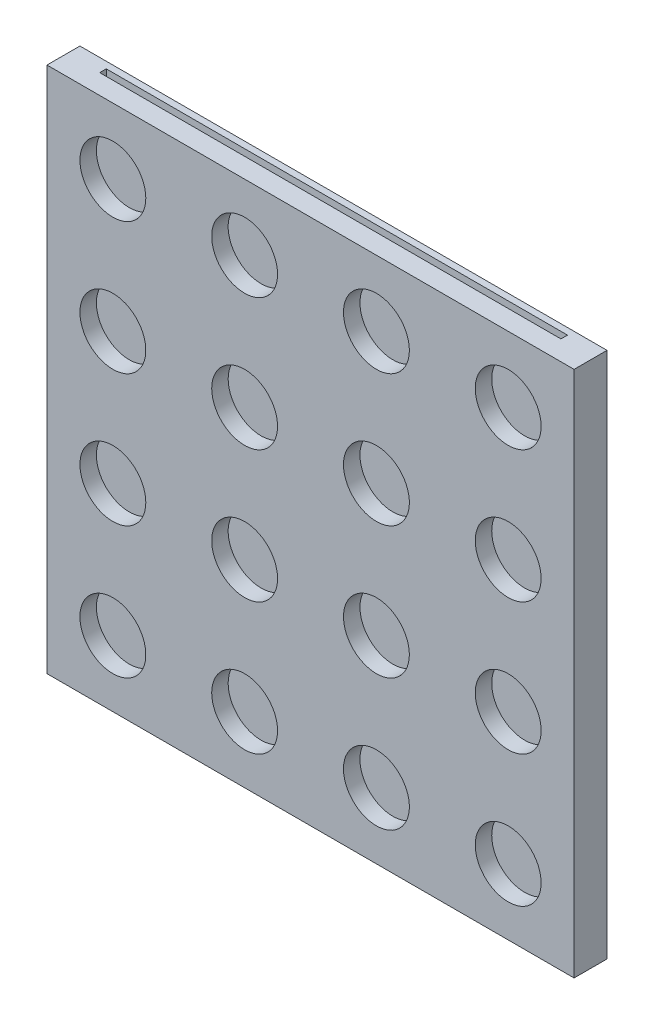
ISO-10303-21;
HEADER;
FILE_DESCRIPTION(('STEP AP214'),'2;1');
FILE_NAME('part.step','',(''),(''),'','','');
FILE_SCHEMA(('AUTOMOTIVE_DESIGN { 1 0 10303 214 1 1 1 1 }'));
ENDSEC;
DATA;
#1=APPLICATION_CONTEXT('core data for automotive mechanical design processes');
#2=APPLICATION_PROTOCOL_DEFINITION('international standard','automotive_design',2000,#1);
#3=PRODUCT_CONTEXT('',#1,'mechanical');
#4=PRODUCT('Part','Part','',(#3));
#5=PRODUCT_RELATED_PRODUCT_CATEGORY('part','',(#4));
#6=PRODUCT_DEFINITION_FORMATION('','',#4);
#7=PRODUCT_DEFINITION_CONTEXT('part definition',#1,'design');
#8=PRODUCT_DEFINITION('design','',#6,#7);
#9=PRODUCT_DEFINITION_SHAPE('','',#8);
#10=(LENGTH_UNIT() NAMED_UNIT(*) SI_UNIT(.MILLI.,.METRE.));
#11=(NAMED_UNIT(*) PLANE_ANGLE_UNIT() SI_UNIT($,.RADIAN.));
#12=(NAMED_UNIT(*) SI_UNIT($,.STERADIAN.) SOLID_ANGLE_UNIT());
#13=UNCERTAINTY_MEASURE_WITH_UNIT(LENGTH_MEASURE(1.E-05),#10,'distance_accuracy_value','');
#14=(GEOMETRIC_REPRESENTATION_CONTEXT(3) GLOBAL_UNCERTAINTY_ASSIGNED_CONTEXT((#13)) GLOBAL_UNIT_ASSIGNED_CONTEXT((#10,
#11,#12)) REPRESENTATION_CONTEXT('',''));
#15=CARTESIAN_POINT('',(0.,0.,0.));
#16=DIRECTION('',(0.,0.,1.));
#17=DIRECTION('',(1.,0.,0.));
#18=AXIS2_PLACEMENT_3D('',#15,#16,#17);
#19=CARTESIAN_POINT('',(0.,0.,6.35));
#20=DIRECTION('',(0.,0.,-1.));
#21=DIRECTION('',(-1.,0.,0.));
#22=AXIS2_PLACEMENT_3D('',#19,#20,#21);
#23=PLANE('',#22);
#24=CARTESIAN_POINT('',(12.7,63.5,6.35));
#25=DIRECTION('',(0.,0.,-1.));
#26=DIRECTION('',(-1.,0.,0.));
#27=AXIS2_PLACEMENT_3D('',#24,#25,#26);
#28=CIRCLE('',#27,6.35);
#29=CARTESIAN_POINT('',(6.35,63.5,6.35));
#30=VERTEX_POINT('',#29);
#31=EDGE_CURVE('E257',#30,#30,#28,.T.);
#32=ORIENTED_EDGE('',*,*,#31,.T.);
#33=EDGE_LOOP('',(#32));
#34=FACE_BOUND('',#33,.T.);
#35=CARTESIAN_POINT('',(63.5,88.9,6.35));
#36=DIRECTION('',(0.,0.,1.));
#37=DIRECTION('',(1.,0.,0.));
#38=AXIS2_PLACEMENT_3D('',#35,#36,#37);
#39=CIRCLE('',#38,6.34999999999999);
#40=CARTESIAN_POINT('',(69.85,88.9,6.35));
#41=VERTEX_POINT('',#40);
#42=EDGE_CURVE('E273',#41,#41,#39,.T.);
#43=ORIENTED_EDGE('',*,*,#42,.F.);
#44=EDGE_LOOP('',(#43));
#45=FACE_BOUND('',#44,.T.);
#46=CARTESIAN_POINT('',(12.7,38.1,6.35));
#47=DIRECTION('',(0.,0.,1.));
#48=DIRECTION('',(1.,0.,0.));
#49=AXIS2_PLACEMENT_3D('',#46,#47,#48);
#50=CIRCLE('',#49,6.35);
#51=CARTESIAN_POINT('',(19.05,38.1,6.35));
#52=VERTEX_POINT('',#51);
#53=EDGE_CURVE('E225',#52,#52,#50,.T.);
#54=ORIENTED_EDGE('',*,*,#53,.F.);
#55=EDGE_LOOP('',(#54));
#56=FACE_BOUND('',#55,.T.);
#57=CARTESIAN_POINT('',(88.9,63.5,6.35));
#58=DIRECTION('',(0.,0.,-1.));
#59=DIRECTION('',(-1.,0.,0.));
#60=AXIS2_PLACEMENT_3D('',#57,#58,#59);
#61=CIRCLE('',#60,6.34999999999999);
#62=CARTESIAN_POINT('',(82.55,63.5,6.35));
#63=VERTEX_POINT('',#62);
#64=EDGE_CURVE('E216',#63,#63,#61,.T.);
#65=ORIENTED_EDGE('',*,*,#64,.T.);
#66=EDGE_LOOP('',(#65));
#67=FACE_BOUND('',#66,.T.);
#68=CARTESIAN_POINT('',(63.5,63.5,6.35));
#69=DIRECTION('',(0.,0.,-1.));
#70=DIRECTION('',(-1.,0.,0.));
#71=AXIS2_PLACEMENT_3D('',#68,#69,#70);
#72=CIRCLE('',#71,6.34999999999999);
#73=CARTESIAN_POINT('',(57.15,63.5,6.35));
#74=VERTEX_POINT('',#73);
#75=EDGE_CURVE('E241',#74,#74,#72,.T.);
#76=ORIENTED_EDGE('',*,*,#75,.T.);
#77=EDGE_LOOP('',(#76));
#78=FACE_BOUND('',#77,.T.);
#79=CARTESIAN_POINT('',(38.1,63.5,6.35));
#80=DIRECTION('',(0.,0.,-1.));
#81=DIRECTION('',(-1.,0.,0.));
#82=AXIS2_PLACEMENT_3D('',#79,#80,#81);
#83=CIRCLE('',#82,6.35);
#84=CARTESIAN_POINT('',(31.75,63.5,6.35));
#85=VERTEX_POINT('',#84);
#86=EDGE_CURVE('E232',#85,#85,#83,.T.);
#87=ORIENTED_EDGE('',*,*,#86,.T.);
#88=EDGE_LOOP('',(#87));
#89=FACE_BOUND('',#88,.T.);
#90=CARTESIAN_POINT('',(38.1,38.1,6.35));
#91=DIRECTION('',(0.,0.,1.));
#92=DIRECTION('',(1.,0.,0.));
#93=AXIS2_PLACEMENT_3D('',#90,#91,#92);
#94=CIRCLE('',#93,6.35);
#95=CARTESIAN_POINT('',(44.45,38.1,6.35));
#96=VERTEX_POINT('',#95);
#97=EDGE_CURVE('E200',#96,#96,#94,.T.);
#98=ORIENTED_EDGE('',*,*,#97,.F.);
#99=EDGE_LOOP('',(#98));
#100=FACE_BOUND('',#99,.T.);
#101=CARTESIAN_POINT('',(88.9,38.1,6.35));
#102=DIRECTION('',(0.,0.,1.));
#103=DIRECTION('',(1.,0.,0.));
#104=AXIS2_PLACEMENT_3D('',#101,#102,#103);
#105=CIRCLE('',#104,6.35);
#106=CARTESIAN_POINT('',(95.25,38.1,6.35));
#107=VERTEX_POINT('',#106);
#108=EDGE_CURVE('E184',#107,#107,#105,.T.);
#109=ORIENTED_EDGE('',*,*,#108,.F.);
#110=EDGE_LOOP('',(#109));
#111=FACE_BOUND('',#110,.T.);
#112=CARTESIAN_POINT('',(12.7,12.7,6.35));
#113=DIRECTION('',(0.,0.,-1.));
#114=DIRECTION('',(-1.,0.,0.));
#115=AXIS2_PLACEMENT_3D('',#112,#113,#114);
#116=CIRCLE('',#115,6.35);
#117=CARTESIAN_POINT('',(6.35,12.7,6.35));
#118=VERTEX_POINT('',#117);
#119=EDGE_CURVE('E193',#118,#118,#116,.T.);
#120=ORIENTED_EDGE('',*,*,#119,.T.);
#121=EDGE_LOOP('',(#120));
#122=FACE_BOUND('',#121,.T.);
#123=DIRECTION('',(0.,-1.,0.));
#124=VECTOR('',#123,1.);
#125=CARTESIAN_POINT('',(0.,0.,6.35));
#126=LINE('',#125,#124);
#127=CARTESIAN_POINT('',(0.,101.6,6.35));
#128=VERTEX_POINT('',#127);
#129=CARTESIAN_POINT('',(0.,0.,6.35));
#130=VERTEX_POINT('',#129);
#131=EDGE_CURVE('E288',#128,#130,#126,.T.);
#132=ORIENTED_EDGE('',*,*,#131,.T.);
#133=DIRECTION('',(1.,0.,0.));
#134=VECTOR('',#133,1.);
#135=CARTESIAN_POINT('',(0.,0.,6.35));
#136=LINE('',#135,#134);
#137=CARTESIAN_POINT('',(101.6,0.,6.35));
#138=VERTEX_POINT('',#137);
#139=EDGE_CURVE('E292',#130,#138,#136,.T.);
#140=ORIENTED_EDGE('',*,*,#139,.T.);
#141=DIRECTION('',(0.,1.,0.));
#142=VECTOR('',#141,1.);
#143=CARTESIAN_POINT('',(101.6,0.,6.35));
#144=LINE('',#143,#142);
#145=CARTESIAN_POINT('',(101.6,101.6,6.35));
#146=VERTEX_POINT('',#145);
#147=EDGE_CURVE('E296',#138,#146,#144,.T.);
#148=ORIENTED_EDGE('',*,*,#147,.T.);
#149=DIRECTION('',(-1.,0.,0.));
#150=VECTOR('',#149,1.);
#151=CARTESIAN_POINT('',(0.,101.6,6.35));
#152=LINE('',#151,#150);
#153=EDGE_CURVE('E299',#146,#128,#152,.T.);
#154=ORIENTED_EDGE('',*,*,#153,.T.);
#155=EDGE_LOOP('',(#132,#140,#148,#154));
#156=FACE_BOUND('',#155,.T.);
#157=CARTESIAN_POINT('',(63.5,38.1,6.35));
#158=DIRECTION('',(0.,0.,1.));
#159=DIRECTION('',(1.,0.,0.));
#160=AXIS2_PLACEMENT_3D('',#157,#158,#159);
#161=CIRCLE('',#160,6.35);
#162=CARTESIAN_POINT('',(69.85,38.1,6.35));
#163=VERTEX_POINT('',#162);
#164=EDGE_CURVE('E209',#163,#163,#161,.T.);
#165=ORIENTED_EDGE('',*,*,#164,.F.);
#166=EDGE_LOOP('',(#165));
#167=FACE_BOUND('',#166,.T.);
#168=CARTESIAN_POINT('',(38.1,12.7,6.35));
#169=DIRECTION('',(0.,0.,-1.));
#170=DIRECTION('',(-1.,0.,0.));
#171=AXIS2_PLACEMENT_3D('',#168,#169,#170);
#172=CIRCLE('',#171,6.35);
#173=CARTESIAN_POINT('',(31.75,12.7,6.35));
#174=VERTEX_POINT('',#173);
#175=EDGE_CURVE('E160',#174,#174,#172,.T.);
#176=ORIENTED_EDGE('',*,*,#175,.T.);
#177=EDGE_LOOP('',(#176));
#178=FACE_BOUND('',#177,.T.);
#179=CARTESIAN_POINT('',(63.5,12.7,6.35));
#180=DIRECTION('',(0.,0.,-1.));
#181=DIRECTION('',(-1.,0.,0.));
#182=AXIS2_PLACEMENT_3D('',#179,#180,#181);
#183=CIRCLE('',#182,6.35);
#184=CARTESIAN_POINT('',(57.15,12.7,6.35));
#185=VERTEX_POINT('',#184);
#186=EDGE_CURVE('E169',#185,#185,#183,.T.);
#187=ORIENTED_EDGE('',*,*,#186,.T.);
#188=EDGE_LOOP('',(#187));
#189=FACE_BOUND('',#188,.T.);
#190=CARTESIAN_POINT('',(88.9,12.7,6.35));
#191=DIRECTION('',(0.,0.,-1.));
#192=DIRECTION('',(-1.,0.,0.));
#193=AXIS2_PLACEMENT_3D('',#190,#191,#192);
#194=CIRCLE('',#193,6.35);
#195=CARTESIAN_POINT('',(82.55,12.7,6.35));
#196=VERTEX_POINT('',#195);
#197=EDGE_CURVE('E177',#196,#196,#194,.T.);
#198=ORIENTED_EDGE('',*,*,#197,.T.);
#199=EDGE_LOOP('',(#198));
#200=FACE_BOUND('',#199,.T.);
#201=CARTESIAN_POINT('',(12.7,88.9,6.35));
#202=DIRECTION('',(0.,0.,1.));
#203=DIRECTION('',(1.,0.,0.));
#204=AXIS2_PLACEMENT_3D('',#201,#202,#203);
#205=CIRCLE('',#204,6.35);
#206=CARTESIAN_POINT('',(19.05,88.9,6.35));
#207=VERTEX_POINT('',#206);
#208=EDGE_CURVE('E280',#207,#207,#205,.T.);
#209=ORIENTED_EDGE('',*,*,#208,.F.);
#210=EDGE_LOOP('',(#209));
#211=FACE_BOUND('',#210,.T.);
#212=CARTESIAN_POINT('',(38.1,88.9,6.35));
#213=DIRECTION('',(0.,0.,1.));
#214=DIRECTION('',(1.,0.,0.));
#215=AXIS2_PLACEMENT_3D('',#212,#213,#214);
#216=CIRCLE('',#215,6.35);
#217=CARTESIAN_POINT('',(44.45,88.9,6.35));
#218=VERTEX_POINT('',#217);
#219=EDGE_CURVE('E264',#218,#218,#216,.T.);
#220=ORIENTED_EDGE('',*,*,#219,.F.);
#221=EDGE_LOOP('',(#220));
#222=FACE_BOUND('',#221,.T.);
#223=CARTESIAN_POINT('',(88.9,88.9,6.35));
#224=DIRECTION('',(0.,0.,1.));
#225=DIRECTION('',(1.,0.,0.));
#226=AXIS2_PLACEMENT_3D('',#223,#224,#225);
#227=CIRCLE('',#226,6.34999999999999);
#228=CARTESIAN_POINT('',(95.25,88.9,6.35));
#229=VERTEX_POINT('',#228);
#230=EDGE_CURVE('E248',#229,#229,#227,.T.);
#231=ORIENTED_EDGE('',*,*,#230,.F.);
#232=EDGE_LOOP('',(#231));
#233=FACE_BOUND('',#232,.T.);
#234=ADVANCED_FACE('F45',(#34,#45,#56,#67,#78,#89,#100,#111,#122,#156,#167,#178,#189,#200,#211,
#222,#233),#23,.F.);
#235=CARTESIAN_POINT('',(0.,0.,6.35));
#236=DIRECTION('',(1.,0.,0.));
#237=DIRECTION('',(0.,0.,-1.));
#238=AXIS2_PLACEMENT_3D('',#235,#236,#237);
#239=PLANE('',#238);
#240=DIRECTION('',(0.,-1.,0.));
#241=VECTOR('',#240,1.);
#242=CARTESIAN_POINT('',(0.,0.,0.));
#243=LINE('',#242,#241);
#244=CARTESIAN_POINT('',(0.,101.6,0.));
#245=VERTEX_POINT('',#244);
#246=CARTESIAN_POINT('',(0.,0.,0.));
#247=VERTEX_POINT('',#246);
#248=EDGE_CURVE('E284',#245,#247,#243,.T.);
#249=ORIENTED_EDGE('',*,*,#248,.T.);
#250=DIRECTION('',(0.,0.,-1.));
#251=VECTOR('',#250,1.);
#252=CARTESIAN_POINT('',(0.,0.,6.35));
#253=LINE('',#252,#251);
#254=EDGE_CURVE('E11',#130,#247,#253,.T.);
#255=ORIENTED_EDGE('',*,*,#254,.F.);
#256=ORIENTED_EDGE('',*,*,#131,.F.);
#257=DIRECTION('',(0.,0.,-1.));
#258=VECTOR('',#257,1.);
#259=CARTESIAN_POINT('',(0.,101.6,6.35));
#260=LINE('',#259,#258);
#261=EDGE_CURVE('E302',#128,#245,#260,.T.);
#262=ORIENTED_EDGE('',*,*,#261,.T.);
#263=EDGE_LOOP('',(#249,#255,#256,#262));
#264=FACE_BOUND('',#263,.T.);
#265=ADVANCED_FACE('F47',(#264),#239,.F.);
#266=CARTESIAN_POINT('',(0.,0.,6.35));
#267=DIRECTION('',(0.,1.,0.));
#268=DIRECTION('',(0.,0.,1.));
#269=AXIS2_PLACEMENT_3D('',#266,#267,#268);
#270=PLANE('',#269);
#271=DIRECTION('',(1.,0.,0.));
#272=VECTOR('',#271,1.);
#273=CARTESIAN_POINT('',(0.,0.,0.));
#274=LINE('',#273,#272);
#275=CARTESIAN_POINT('',(101.6,0.,0.));
#276=VERTEX_POINT('',#275);
#277=EDGE_CURVE('E306',#247,#276,#274,.T.);
#278=ORIENTED_EDGE('',*,*,#277,.T.);
#279=DIRECTION('',(0.,0.,-1.));
#280=VECTOR('',#279,1.);
#281=CARTESIAN_POINT('',(101.6,0.,6.35));
#282=LINE('',#281,#280);
#283=EDGE_CURVE('E54',#138,#276,#282,.T.);
#284=ORIENTED_EDGE('',*,*,#283,.F.);
#285=ORIENTED_EDGE('',*,*,#139,.F.);
#286=ORIENTED_EDGE('',*,*,#254,.T.);
#287=EDGE_LOOP('',(#278,#284,#285,#286));
#288=FACE_BOUND('',#287,.T.);
#289=ADVANCED_FACE('F342',(#288),#270,.F.);
#290=CARTESIAN_POINT('',(101.6,0.,6.35));
#291=DIRECTION('',(-1.,0.,0.));
#292=DIRECTION('',(0.,0.,1.));
#293=AXIS2_PLACEMENT_3D('',#290,#291,#292);
#294=PLANE('',#293);
#295=DIRECTION('',(0.,1.,0.));
#296=VECTOR('',#295,1.);
#297=CARTESIAN_POINT('',(101.6,0.,0.));
#298=LINE('',#297,#296);
#299=CARTESIAN_POINT('',(101.6,101.6,0.));
#300=VERTEX_POINT('',#299);
#301=EDGE_CURVE('E309',#276,#300,#298,.T.);
#302=ORIENTED_EDGE('',*,*,#301,.T.);
#303=DIRECTION('',(0.,0.,-1.));
#304=VECTOR('',#303,1.);
#305=CARTESIAN_POINT('',(101.6,101.6,6.35));
#306=LINE('',#305,#304);
#307=EDGE_CURVE('E317',#146,#300,#306,.T.);
#308=ORIENTED_EDGE('',*,*,#307,.F.);
#309=ORIENTED_EDGE('',*,*,#147,.F.);
#310=ORIENTED_EDGE('',*,*,#283,.T.);
#311=EDGE_LOOP('',(#302,#308,#309,#310));
#312=FACE_BOUND('',#311,.T.);
#313=ADVANCED_FACE('F326',(#312),#294,.F.);
#314=CARTESIAN_POINT('',(0.,101.6,6.35));
#315=DIRECTION('',(0.,-1.,0.));
#316=DIRECTION('',(0.,0.,-1.));
#317=AXIS2_PLACEMENT_3D('',#314,#315,#316);
#318=PLANE('',#317);
#319=DIRECTION('',(0.,0.,1.));
#320=VECTOR('',#319,1.);
#321=CARTESIAN_POINT('',(6.34999999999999,101.6,1.27000000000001));
#322=LINE('',#321,#320);
#323=CARTESIAN_POINT('',(6.34999999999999,101.6,1.27000000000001));
#324=VERTEX_POINT('',#323);
#325=CARTESIAN_POINT('',(6.35,101.6,2.54000000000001));
#326=VERTEX_POINT('',#325);
#327=EDGE_CURVE('E371',#324,#326,#322,.T.);
#328=ORIENTED_EDGE('',*,*,#327,.F.);
#329=DIRECTION('',(-1.,0.,0.));
#330=VECTOR('',#329,1.);
#331=CARTESIAN_POINT('',(95.25,101.6,1.27));
#332=LINE('',#331,#330);
#333=CARTESIAN_POINT('',(95.25,101.6,1.27));
#334=VERTEX_POINT('',#333);
#335=EDGE_CURVE('E61',#334,#324,#332,.T.);
#336=ORIENTED_EDGE('',*,*,#335,.F.);
#337=DIRECTION('',(0.,0.,-1.));
#338=VECTOR('',#337,1.);
#339=CARTESIAN_POINT('',(95.25,101.6,2.54000000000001));
#340=LINE('',#339,#338);
#341=CARTESIAN_POINT('',(95.25,101.6,2.54000000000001));
#342=VERTEX_POINT('',#341);
#343=EDGE_CURVE('E132',#342,#334,#340,.T.);
#344=ORIENTED_EDGE('',*,*,#343,.F.);
#345=DIRECTION('',(1.,0.,0.));
#346=VECTOR('',#345,1.);
#347=CARTESIAN_POINT('',(6.35,101.6,2.54000000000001));
#348=LINE('',#347,#346);
#349=EDGE_CURVE('E374',#326,#342,#348,.T.);
#350=ORIENTED_EDGE('',*,*,#349,.F.);
#351=EDGE_LOOP('',(#328,#336,#344,#350));
#352=FACE_BOUND('',#351,.T.);
#353=DIRECTION('',(-1.,0.,0.));
#354=VECTOR('',#353,1.);
#355=CARTESIAN_POINT('',(0.,101.6,0.));
#356=LINE('',#355,#354);
#357=EDGE_CURVE('E293',#300,#245,#356,.T.);
#358=ORIENTED_EDGE('',*,*,#357,.T.);
#359=ORIENTED_EDGE('',*,*,#261,.F.);
#360=ORIENTED_EDGE('',*,*,#153,.F.);
#361=ORIENTED_EDGE('',*,*,#307,.T.);
#362=EDGE_LOOP('',(#358,#359,#360,#361));
#363=FACE_BOUND('',#362,.T.);
#364=ADVANCED_FACE('F335',(#352,#363),#318,.F.);
#365=CARTESIAN_POINT('',(0.,0.,0.));
#366=DIRECTION('',(0.,0.,-1.));
#367=DIRECTION('',(-1.,0.,0.));
#368=AXIS2_PLACEMENT_3D('',#365,#366,#367);
#369=PLANE('',#368);
#370=DIRECTION('',(0.,-1.,0.));
#371=VECTOR('',#370,1.);
#372=CARTESIAN_POINT('',(95.25,95.25,0.));
#373=LINE('',#372,#371);
#374=CARTESIAN_POINT('',(95.25,95.25,0.));
#375=VERTEX_POINT('',#374);
#376=CARTESIAN_POINT('',(95.25,6.35,0.));
#377=VERTEX_POINT('',#376);
#378=EDGE_CURVE('E69',#375,#377,#373,.T.);
#379=ORIENTED_EDGE('',*,*,#378,.F.);
#380=DIRECTION('',(1.,0.,0.));
#381=VECTOR('',#380,1.);
#382=CARTESIAN_POINT('',(6.35,95.25,0.));
#383=LINE('',#382,#381);
#384=CARTESIAN_POINT('',(6.35,95.25,0.));
#385=VERTEX_POINT('',#384);
#386=EDGE_CURVE('E393',#385,#375,#383,.T.);
#387=ORIENTED_EDGE('',*,*,#386,.F.);
#388=DIRECTION('',(0.,1.,0.));
#389=VECTOR('',#388,1.);
#390=CARTESIAN_POINT('',(6.34999999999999,6.35,0.));
#391=LINE('',#390,#389);
#392=CARTESIAN_POINT('',(6.34999999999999,6.35,0.));
#393=VERTEX_POINT('',#392);
#394=EDGE_CURVE('E144',#393,#385,#391,.T.);
#395=ORIENTED_EDGE('',*,*,#394,.F.);
#396=DIRECTION('',(-1.,0.,0.));
#397=VECTOR('',#396,1.);
#398=CARTESIAN_POINT('',(95.25,6.35,0.));
#399=LINE('',#398,#397);
#400=EDGE_CURVE('E401',#377,#393,#399,.T.);
#401=ORIENTED_EDGE('',*,*,#400,.F.);
#402=EDGE_LOOP('',(#379,#387,#395,#401));
#403=FACE_BOUND('',#402,.T.);
#404=ORIENTED_EDGE('',*,*,#248,.F.);
#405=ORIENTED_EDGE('',*,*,#357,.F.);
#406=ORIENTED_EDGE('',*,*,#301,.F.);
#407=ORIENTED_EDGE('',*,*,#277,.F.);
#408=EDGE_LOOP('',(#404,#405,#406,#407));
#409=FACE_BOUND('',#408,.T.);
#410=ADVANCED_FACE('F332',(#403,#409),#369,.T.);
#411=CARTESIAN_POINT('',(12.7,12.7,3.175));
#412=DIRECTION('',(0.,0.,1.));
#413=DIRECTION('',(1.,0.,0.));
#414=AXIS2_PLACEMENT_3D('',#411,#412,#413);
#415=CYLINDRICAL_SURFACE('',#414,6.35);
#416=CARTESIAN_POINT('',(12.7,12.7,3.175));
#417=DIRECTION('',(0.,0.,-1.));
#418=DIRECTION('',(-1.,0.,0.));
#419=AXIS2_PLACEMENT_3D('',#416,#417,#418);
#420=CIRCLE('',#419,6.35);
#421=CARTESIAN_POINT('',(6.35,12.7,3.175));
#422=VERTEX_POINT('',#421);
#423=EDGE_CURVE('E164',#422,#422,#420,.T.);
#424=ORIENTED_EDGE('',*,*,#423,.T.);
#425=EDGE_LOOP('',(#424));
#426=FACE_BOUND('',#425,.T.);
#427=ORIENTED_EDGE('',*,*,#119,.F.);
#428=EDGE_LOOP('',(#427));
#429=FACE_BOUND('',#428,.T.);
#430=ADVANCED_FACE('F362',(#426,#429),#415,.F.);
#431=CARTESIAN_POINT('',(12.7,12.7,3.175));
#432=DIRECTION('',(0.,0.,-1.));
#433=DIRECTION('',(-1.,0.,0.));
#434=AXIS2_PLACEMENT_3D('',#431,#432,#433);
#435=PLANE('',#434);
#436=ORIENTED_EDGE('',*,*,#423,.F.);
#437=EDGE_LOOP('',(#436));
#438=FACE_BOUND('',#437,.T.);
#439=ADVANCED_FACE('F458',(#438),#435,.F.);
#440=CARTESIAN_POINT('',(88.9,38.1,3.175));
#441=DIRECTION('',(0.,0.,1.));
#442=DIRECTION('',(1.,0.,0.));
#443=AXIS2_PLACEMENT_3D('',#440,#441,#442);
#444=CYLINDRICAL_SURFACE('',#443,6.35);
#445=CARTESIAN_POINT('',(88.9,38.1,3.175));
#446=DIRECTION('',(0.,0.,1.));
#447=DIRECTION('',(1.,0.,0.));
#448=AXIS2_PLACEMENT_3D('',#445,#446,#447);
#449=CIRCLE('',#448,6.35);
#450=CARTESIAN_POINT('',(95.25,38.1,3.175));
#451=VERTEX_POINT('',#450);
#452=EDGE_CURVE('E189',#451,#451,#449,.T.);
#453=ORIENTED_EDGE('',*,*,#452,.F.);
#454=EDGE_LOOP('',(#453));
#455=FACE_BOUND('',#454,.T.);
#456=ORIENTED_EDGE('',*,*,#108,.T.);
#457=EDGE_LOOP('',(#456));
#458=FACE_BOUND('',#457,.T.);
#459=ADVANCED_FACE('F454',(#455,#458),#444,.F.);
#460=CARTESIAN_POINT('',(88.9,38.1,3.175));
#461=DIRECTION('',(0.,0.,1.));
#462=DIRECTION('',(1.,0.,0.));
#463=AXIS2_PLACEMENT_3D('',#460,#461,#462);
#464=PLANE('',#463);
#465=ORIENTED_EDGE('',*,*,#452,.T.);
#466=EDGE_LOOP('',(#465));
#467=FACE_BOUND('',#466,.T.);
#468=ADVANCED_FACE('F457',(#467),#464,.T.);
#469=CARTESIAN_POINT('',(63.5,38.1,3.175));
#470=DIRECTION('',(0.,0.,1.));
#471=DIRECTION('',(1.,0.,0.));
#472=AXIS2_PLACEMENT_3D('',#469,#470,#471);
#473=CYLINDRICAL_SURFACE('',#472,6.35);
#474=CARTESIAN_POINT('',(63.5,38.1,3.175));
#475=DIRECTION('',(0.,0.,1.));
#476=DIRECTION('',(1.,0.,0.));
#477=AXIS2_PLACEMENT_3D('',#474,#475,#476);
#478=CIRCLE('',#477,6.35);
#479=CARTESIAN_POINT('',(69.85,38.1,3.175));
#480=VERTEX_POINT('',#479);
#481=EDGE_CURVE('E188',#480,#480,#478,.T.);
#482=ORIENTED_EDGE('',*,*,#481,.F.);
#483=EDGE_LOOP('',(#482));
#484=FACE_BOUND('',#483,.T.);
#485=ORIENTED_EDGE('',*,*,#164,.T.);
#486=EDGE_LOOP('',(#485));
#487=FACE_BOUND('',#486,.T.);
#488=ADVANCED_FACE('F462',(#484,#487),#473,.F.);
#489=CARTESIAN_POINT('',(63.5,38.1,3.175));
#490=DIRECTION('',(0.,0.,1.));
#491=DIRECTION('',(1.,0.,0.));
#492=AXIS2_PLACEMENT_3D('',#489,#490,#491);
#493=PLANE('',#492);
#494=ORIENTED_EDGE('',*,*,#481,.T.);
#495=EDGE_LOOP('',(#494));
#496=FACE_BOUND('',#495,.T.);
#497=ADVANCED_FACE('F472',(#496),#493,.T.);
#498=CARTESIAN_POINT('',(38.1,38.1,3.175));
#499=DIRECTION('',(0.,0.,1.));
#500=DIRECTION('',(1.,0.,0.));
#501=AXIS2_PLACEMENT_3D('',#498,#499,#500);
#502=CYLINDRICAL_SURFACE('',#501,6.35);
#503=CARTESIAN_POINT('',(38.1,38.1,3.175));
#504=DIRECTION('',(0.,0.,1.));
#505=DIRECTION('',(1.,0.,0.));
#506=AXIS2_PLACEMENT_3D('',#503,#504,#505);
#507=CIRCLE('',#506,6.35);
#508=CARTESIAN_POINT('',(44.45,38.1,3.175));
#509=VERTEX_POINT('',#508);
#510=EDGE_CURVE('E205',#509,#509,#507,.T.);
#511=ORIENTED_EDGE('',*,*,#510,.F.);
#512=EDGE_LOOP('',(#511));
#513=FACE_BOUND('',#512,.T.);
#514=ORIENTED_EDGE('',*,*,#97,.T.);
#515=EDGE_LOOP('',(#514));
#516=FACE_BOUND('',#515,.T.);
#517=ADVANCED_FACE('F469',(#513,#516),#502,.F.);
#518=CARTESIAN_POINT('',(38.1,38.1,3.175));
#519=DIRECTION('',(0.,0.,1.));
#520=DIRECTION('',(1.,0.,0.));
#521=AXIS2_PLACEMENT_3D('',#518,#519,#520);
#522=PLANE('',#521);
#523=ORIENTED_EDGE('',*,*,#510,.T.);
#524=EDGE_LOOP('',(#523));
#525=FACE_BOUND('',#524,.T.);
#526=ADVANCED_FACE('F432',(#525),#522,.T.);
#527=CARTESIAN_POINT('',(38.1,12.7,3.175));
#528=DIRECTION('',(0.,0.,1.));
#529=DIRECTION('',(1.,0.,0.));
#530=AXIS2_PLACEMENT_3D('',#527,#528,#529);
#531=CYLINDRICAL_SURFACE('',#530,6.35);
#532=CARTESIAN_POINT('',(38.1,12.7,3.175));
#533=DIRECTION('',(0.,0.,-1.));
#534=DIRECTION('',(-1.,0.,0.));
#535=AXIS2_PLACEMENT_3D('',#532,#533,#534);
#536=CIRCLE('',#535,6.35);
#537=CARTESIAN_POINT('',(31.75,12.7,3.175));
#538=VERTEX_POINT('',#537);
#539=EDGE_CURVE('E165',#538,#538,#536,.T.);
#540=ORIENTED_EDGE('',*,*,#539,.T.);
#541=EDGE_LOOP('',(#540));
#542=FACE_BOUND('',#541,.T.);
#543=ORIENTED_EDGE('',*,*,#175,.F.);
#544=EDGE_LOOP('',(#543));
#545=FACE_BOUND('',#544,.T.);
#546=ADVANCED_FACE('F428',(#542,#545),#531,.F.);
#547=CARTESIAN_POINT('',(38.1,12.7,3.175));
#548=DIRECTION('',(0.,0.,-1.));
#549=DIRECTION('',(-1.,0.,0.));
#550=AXIS2_PLACEMENT_3D('',#547,#548,#549);
#551=PLANE('',#550);
#552=ORIENTED_EDGE('',*,*,#539,.F.);
#553=EDGE_LOOP('',(#552));
#554=FACE_BOUND('',#553,.T.);
#555=ADVANCED_FACE('F431',(#554),#551,.F.);
#556=CARTESIAN_POINT('',(63.5,12.7,3.175));
#557=DIRECTION('',(0.,0.,1.));
#558=DIRECTION('',(1.,0.,0.));
#559=AXIS2_PLACEMENT_3D('',#556,#557,#558);
#560=CYLINDRICAL_SURFACE('',#559,6.35);
#561=CARTESIAN_POINT('',(63.5,12.7,3.175));
#562=DIRECTION('',(0.,0.,-1.));
#563=DIRECTION('',(-1.,0.,0.));
#564=AXIS2_PLACEMENT_3D('',#561,#562,#563);
#565=CIRCLE('',#564,6.35);
#566=CARTESIAN_POINT('',(57.15,12.7,3.175));
#567=VERTEX_POINT('',#566);
#568=EDGE_CURVE('E173',#567,#567,#565,.T.);
#569=ORIENTED_EDGE('',*,*,#568,.T.);
#570=EDGE_LOOP('',(#569));
#571=FACE_BOUND('',#570,.T.);
#572=ORIENTED_EDGE('',*,*,#186,.F.);
#573=EDGE_LOOP('',(#572));
#574=FACE_BOUND('',#573,.T.);
#575=ADVANCED_FACE('F436',(#571,#574),#560,.F.);
#576=CARTESIAN_POINT('',(63.5,12.7,3.175));
#577=DIRECTION('',(0.,0.,-1.));
#578=DIRECTION('',(-1.,0.,0.));
#579=AXIS2_PLACEMENT_3D('',#576,#577,#578);
#580=PLANE('',#579);
#581=ORIENTED_EDGE('',*,*,#568,.F.);
#582=EDGE_LOOP('',(#581));
#583=FACE_BOUND('',#582,.T.);
#584=ADVANCED_FACE('F440',(#583),#580,.F.);
#585=CARTESIAN_POINT('',(88.9,12.7,3.175));
#586=DIRECTION('',(0.,0.,1.));
#587=DIRECTION('',(1.,0.,0.));
#588=AXIS2_PLACEMENT_3D('',#585,#586,#587);
#589=CYLINDRICAL_SURFACE('',#588,6.35);
#590=CARTESIAN_POINT('',(88.9,12.7,3.175));
#591=DIRECTION('',(0.,0.,-1.));
#592=DIRECTION('',(-1.,0.,0.));
#593=AXIS2_PLACEMENT_3D('',#590,#591,#592);
#594=CIRCLE('',#593,6.35);
#595=CARTESIAN_POINT('',(82.55,12.7,3.175));
#596=VERTEX_POINT('',#595);
#597=EDGE_CURVE('E151',#596,#596,#594,.T.);
#598=ORIENTED_EDGE('',*,*,#597,.T.);
#599=EDGE_LOOP('',(#598));
#600=FACE_BOUND('',#599,.T.);
#601=ORIENTED_EDGE('',*,*,#197,.F.);
#602=EDGE_LOOP('',(#601));
#603=FACE_BOUND('',#602,.T.);
#604=ADVANCED_FACE('F444',(#600,#603),#589,.F.);
#605=CARTESIAN_POINT('',(88.9,12.7,3.175));
#606=DIRECTION('',(0.,0.,-1.));
#607=DIRECTION('',(-1.,0.,0.));
#608=AXIS2_PLACEMENT_3D('',#605,#606,#607);
#609=PLANE('',#608);
#610=ORIENTED_EDGE('',*,*,#597,.F.);
#611=EDGE_LOOP('',(#610));
#612=FACE_BOUND('',#611,.T.);
#613=ADVANCED_FACE('F448',(#612),#609,.F.);
#614=CARTESIAN_POINT('',(12.7,88.9,3.175));
#615=DIRECTION('',(0.,0.,1.));
#616=DIRECTION('',(1.,0.,0.));
#617=AXIS2_PLACEMENT_3D('',#614,#615,#616);
#618=CYLINDRICAL_SURFACE('',#617,6.35);
#619=CARTESIAN_POINT('',(12.7,88.9,3.175));
#620=DIRECTION('',(0.,0.,1.));
#621=DIRECTION('',(1.,0.,0.));
#622=AXIS2_PLACEMENT_3D('',#619,#620,#621);
#623=CIRCLE('',#622,6.35);
#624=CARTESIAN_POINT('',(19.05,88.9,3.175));
#625=VERTEX_POINT('',#624);
#626=EDGE_CURVE('E268',#625,#625,#623,.T.);
#627=ORIENTED_EDGE('',*,*,#626,.F.);
#628=EDGE_LOOP('',(#627));
#629=FACE_BOUND('',#628,.T.);
#630=ORIENTED_EDGE('',*,*,#208,.T.);
#631=EDGE_LOOP('',(#630));
#632=FACE_BOUND('',#631,.T.);
#633=ADVANCED_FACE('F452',(#629,#632),#618,.F.);
#634=CARTESIAN_POINT('',(12.7,88.9,3.175));
#635=DIRECTION('',(0.,0.,1.));
#636=DIRECTION('',(1.,0.,0.));
#637=AXIS2_PLACEMENT_3D('',#634,#635,#636);
#638=PLANE('',#637);
#639=ORIENTED_EDGE('',*,*,#626,.T.);
#640=EDGE_LOOP('',(#639));
#641=FACE_BOUND('',#640,.T.);
#642=ADVANCED_FACE('F358',(#641),#638,.T.);
#643=CARTESIAN_POINT('',(38.1,63.5,3.175));
#644=DIRECTION('',(0.,0.,1.));
#645=DIRECTION('',(1.,0.,0.));
#646=AXIS2_PLACEMENT_3D('',#643,#644,#645);
#647=CYLINDRICAL_SURFACE('',#646,6.35);
#648=CARTESIAN_POINT('',(38.1,63.5,3.175));
#649=DIRECTION('',(0.,0.,-1.));
#650=DIRECTION('',(-1.,0.,0.));
#651=AXIS2_PLACEMENT_3D('',#648,#649,#650);
#652=CIRCLE('',#651,6.35);
#653=CARTESIAN_POINT('',(31.75,63.5,3.175));
#654=VERTEX_POINT('',#653);
#655=EDGE_CURVE('E237',#654,#654,#652,.T.);
#656=ORIENTED_EDGE('',*,*,#655,.T.);
#657=EDGE_LOOP('',(#656));
#658=FACE_BOUND('',#657,.T.);
#659=ORIENTED_EDGE('',*,*,#86,.F.);
#660=EDGE_LOOP('',(#659));
#661=FACE_BOUND('',#660,.T.);
#662=ADVANCED_FACE('F501',(#658,#661),#647,.F.);
#663=CARTESIAN_POINT('',(38.1,63.5,3.175));
#664=DIRECTION('',(0.,0.,-1.));
#665=DIRECTION('',(-1.,0.,0.));
#666=AXIS2_PLACEMENT_3D('',#663,#664,#665);
#667=PLANE('',#666);
#668=ORIENTED_EDGE('',*,*,#655,.F.);
#669=EDGE_LOOP('',(#668));
#670=FACE_BOUND('',#669,.T.);
#671=ADVANCED_FACE('F504',(#670),#667,.F.);
#672=CARTESIAN_POINT('',(63.5,63.5,3.175));
#673=DIRECTION('',(0.,0.,1.));
#674=DIRECTION('',(1.,0.,0.));
#675=AXIS2_PLACEMENT_3D('',#672,#673,#674);
#676=CYLINDRICAL_SURFACE('',#675,6.34999999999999);
#677=CARTESIAN_POINT('',(63.5,63.5,3.175));
#678=DIRECTION('',(0.,0.,-1.));
#679=DIRECTION('',(-1.,0.,0.));
#680=AXIS2_PLACEMENT_3D('',#677,#678,#679);
#681=CIRCLE('',#680,6.34999999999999);
#682=CARTESIAN_POINT('',(57.15,63.5,3.175));
#683=VERTEX_POINT('',#682);
#684=EDGE_CURVE('E220',#683,#683,#681,.T.);
#685=ORIENTED_EDGE('',*,*,#684,.T.);
#686=EDGE_LOOP('',(#685));
#687=FACE_BOUND('',#686,.T.);
#688=ORIENTED_EDGE('',*,*,#75,.F.);
#689=EDGE_LOOP('',(#688));
#690=FACE_BOUND('',#689,.T.);
#691=ADVANCED_FACE('F508',(#687,#690),#676,.F.);
#692=CARTESIAN_POINT('',(63.5,63.5,3.175));
#693=DIRECTION('',(0.,0.,-1.));
#694=DIRECTION('',(-1.,0.,0.));
#695=AXIS2_PLACEMENT_3D('',#692,#693,#694);
#696=PLANE('',#695);
#697=ORIENTED_EDGE('',*,*,#684,.F.);
#698=EDGE_LOOP('',(#697));
#699=FACE_BOUND('',#698,.T.);
#700=ADVANCED_FACE('F487',(#699),#696,.F.);
#701=CARTESIAN_POINT('',(88.9,63.5,3.175));
#702=DIRECTION('',(0.,0.,1.));
#703=DIRECTION('',(1.,0.,0.));
#704=AXIS2_PLACEMENT_3D('',#701,#702,#703);
#705=CYLINDRICAL_SURFACE('',#704,6.34999999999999);
#706=CARTESIAN_POINT('',(88.9,63.5,3.175));
#707=DIRECTION('',(0.,0.,-1.));
#708=DIRECTION('',(-1.,0.,0.));
#709=AXIS2_PLACEMENT_3D('',#706,#707,#708);
#710=CIRCLE('',#709,6.34999999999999);
#711=CARTESIAN_POINT('',(82.55,63.5,3.175));
#712=VERTEX_POINT('',#711);
#713=EDGE_CURVE('E221',#712,#712,#710,.T.);
#714=ORIENTED_EDGE('',*,*,#713,.T.);
#715=EDGE_LOOP('',(#714));
#716=FACE_BOUND('',#715,.T.);
#717=ORIENTED_EDGE('',*,*,#64,.F.);
#718=EDGE_LOOP('',(#717));
#719=FACE_BOUND('',#718,.T.);
#720=ADVANCED_FACE('F483',(#716,#719),#705,.F.);
#721=CARTESIAN_POINT('',(88.9,63.5,3.175));
#722=DIRECTION('',(0.,0.,-1.));
#723=DIRECTION('',(-1.,0.,0.));
#724=AXIS2_PLACEMENT_3D('',#721,#722,#723);
#725=PLANE('',#724);
#726=ORIENTED_EDGE('',*,*,#713,.F.);
#727=EDGE_LOOP('',(#726));
#728=FACE_BOUND('',#727,.T.);
#729=ADVANCED_FACE('F486',(#728),#725,.F.);
#730=CARTESIAN_POINT('',(12.7,38.1,3.175));
#731=DIRECTION('',(0.,0.,1.));
#732=DIRECTION('',(1.,0.,0.));
#733=AXIS2_PLACEMENT_3D('',#730,#731,#732);
#734=CYLINDRICAL_SURFACE('',#733,6.35);
#735=CARTESIAN_POINT('',(12.7,38.1,3.175));
#736=DIRECTION('',(0.,0.,1.));
#737=DIRECTION('',(1.,0.,0.));
#738=AXIS2_PLACEMENT_3D('',#735,#736,#737);
#739=CIRCLE('',#738,6.35);
#740=CARTESIAN_POINT('',(19.05,38.1,3.175));
#741=VERTEX_POINT('',#740);
#742=EDGE_CURVE('E204',#741,#741,#739,.T.);
#743=ORIENTED_EDGE('',*,*,#742,.F.);
#744=EDGE_LOOP('',(#743));
#745=FACE_BOUND('',#744,.T.);
#746=ORIENTED_EDGE('',*,*,#53,.T.);
#747=EDGE_LOOP('',(#746));
#748=FACE_BOUND('',#747,.T.);
#749=ADVANCED_FACE('F491',(#745,#748),#734,.F.);
#750=CARTESIAN_POINT('',(12.7,38.1,3.175));
#751=DIRECTION('',(0.,0.,1.));
#752=DIRECTION('',(1.,0.,0.));
#753=AXIS2_PLACEMENT_3D('',#750,#751,#752);
#754=PLANE('',#753);
#755=ORIENTED_EDGE('',*,*,#742,.T.);
#756=EDGE_LOOP('',(#755));
#757=FACE_BOUND('',#756,.T.);
#758=ADVANCED_FACE('F495',(#757),#754,.T.);
#759=CARTESIAN_POINT('',(38.1,88.9,3.175));
#760=DIRECTION('',(0.,0.,1.));
#761=DIRECTION('',(1.,0.,0.));
#762=AXIS2_PLACEMENT_3D('',#759,#760,#761);
#763=CYLINDRICAL_SURFACE('',#762,6.35);
#764=CARTESIAN_POINT('',(38.1,88.9,3.175));
#765=DIRECTION('',(0.,0.,1.));
#766=DIRECTION('',(1.,0.,0.));
#767=AXIS2_PLACEMENT_3D('',#764,#765,#766);
#768=CIRCLE('',#767,6.35);
#769=CARTESIAN_POINT('',(44.45,88.9,3.175));
#770=VERTEX_POINT('',#769);
#771=EDGE_CURVE('E269',#770,#770,#768,.T.);
#772=ORIENTED_EDGE('',*,*,#771,.F.);
#773=EDGE_LOOP('',(#772));
#774=FACE_BOUND('',#773,.T.);
#775=ORIENTED_EDGE('',*,*,#219,.T.);
#776=EDGE_LOOP('',(#775));
#777=FACE_BOUND('',#776,.T.);
#778=ADVANCED_FACE('F499',(#774,#777),#763,.F.);
#779=CARTESIAN_POINT('',(38.1,88.9,3.175));
#780=DIRECTION('',(0.,0.,1.));
#781=DIRECTION('',(1.,0.,0.));
#782=AXIS2_PLACEMENT_3D('',#779,#780,#781);
#783=PLANE('',#782);
#784=ORIENTED_EDGE('',*,*,#771,.T.);
#785=EDGE_LOOP('',(#784));
#786=FACE_BOUND('',#785,.T.);
#787=ADVANCED_FACE('F534',(#786),#783,.T.);
#788=CARTESIAN_POINT('',(63.5,88.9,3.175));
#789=DIRECTION('',(0.,0.,1.));
#790=DIRECTION('',(1.,0.,0.));
#791=AXIS2_PLACEMENT_3D('',#788,#789,#790);
#792=CYLINDRICAL_SURFACE('',#791,6.34999999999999);
#793=CARTESIAN_POINT('',(63.5,88.9,3.175));
#794=DIRECTION('',(0.,0.,1.));
#795=DIRECTION('',(1.,0.,0.));
#796=AXIS2_PLACEMENT_3D('',#793,#794,#795);
#797=CIRCLE('',#796,6.34999999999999);
#798=CARTESIAN_POINT('',(69.85,88.9,3.175));
#799=VERTEX_POINT('',#798);
#800=EDGE_CURVE('E252',#799,#799,#797,.T.);
#801=ORIENTED_EDGE('',*,*,#800,.F.);
#802=EDGE_LOOP('',(#801));
#803=FACE_BOUND('',#802,.T.);
#804=ORIENTED_EDGE('',*,*,#42,.T.);
#805=EDGE_LOOP('',(#804));
#806=FACE_BOUND('',#805,.T.);
#807=ADVANCED_FACE('F538',(#803,#806),#792,.F.);
#808=CARTESIAN_POINT('',(63.5,88.9,3.175));
#809=DIRECTION('',(0.,0.,1.));
#810=DIRECTION('',(1.,0.,0.));
#811=AXIS2_PLACEMENT_3D('',#808,#809,#810);
#812=PLANE('',#811);
#813=ORIENTED_EDGE('',*,*,#800,.T.);
#814=EDGE_LOOP('',(#813));
#815=FACE_BOUND('',#814,.T.);
#816=ADVANCED_FACE('F520',(#815),#812,.T.);
#817=CARTESIAN_POINT('',(88.9,88.9,3.175));
#818=DIRECTION('',(0.,0.,1.));
#819=DIRECTION('',(1.,0.,0.));
#820=AXIS2_PLACEMENT_3D('',#817,#818,#819);
#821=CYLINDRICAL_SURFACE('',#820,6.34999999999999);
#822=CARTESIAN_POINT('',(88.9,88.9,3.175));
#823=DIRECTION('',(0.,0.,1.));
#824=DIRECTION('',(1.,0.,0.));
#825=AXIS2_PLACEMENT_3D('',#822,#823,#824);
#826=CIRCLE('',#825,6.34999999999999);
#827=CARTESIAN_POINT('',(95.25,88.9,3.175));
#828=VERTEX_POINT('',#827);
#829=EDGE_CURVE('E253',#828,#828,#826,.T.);
#830=ORIENTED_EDGE('',*,*,#829,.F.);
#831=EDGE_LOOP('',(#830));
#832=FACE_BOUND('',#831,.T.);
#833=ORIENTED_EDGE('',*,*,#230,.T.);
#834=EDGE_LOOP('',(#833));
#835=FACE_BOUND('',#834,.T.);
#836=ADVANCED_FACE('F516',(#832,#835),#821,.F.);
#837=CARTESIAN_POINT('',(88.9,88.9,3.175));
#838=DIRECTION('',(0.,0.,1.));
#839=DIRECTION('',(1.,0.,0.));
#840=AXIS2_PLACEMENT_3D('',#837,#838,#839);
#841=PLANE('',#840);
#842=ORIENTED_EDGE('',*,*,#829,.T.);
#843=EDGE_LOOP('',(#842));
#844=FACE_BOUND('',#843,.T.);
#845=ADVANCED_FACE('F519',(#844),#841,.T.);
#846=CARTESIAN_POINT('',(12.7,63.5,3.175));
#847=DIRECTION('',(0.,0.,1.));
#848=DIRECTION('',(1.,0.,0.));
#849=AXIS2_PLACEMENT_3D('',#846,#847,#848);
#850=CYLINDRICAL_SURFACE('',#849,6.35);
#851=CARTESIAN_POINT('',(12.7,63.5,3.175));
#852=DIRECTION('',(0.,0.,-1.));
#853=DIRECTION('',(-1.,0.,0.));
#854=AXIS2_PLACEMENT_3D('',#851,#852,#853);
#855=CIRCLE('',#854,6.35);
#856=CARTESIAN_POINT('',(6.35,63.5,3.175));
#857=VERTEX_POINT('',#856);
#858=EDGE_CURVE('E236',#857,#857,#855,.T.);
#859=ORIENTED_EDGE('',*,*,#858,.T.);
#860=EDGE_LOOP('',(#859));
#861=FACE_BOUND('',#860,.T.);
#862=ORIENTED_EDGE('',*,*,#31,.F.);
#863=EDGE_LOOP('',(#862));
#864=FACE_BOUND('',#863,.T.);
#865=ADVANCED_FACE('F524',(#861,#864),#850,.F.);
#866=CARTESIAN_POINT('',(12.7,63.5,3.175));
#867=DIRECTION('',(0.,0.,-1.));
#868=DIRECTION('',(-1.,0.,0.));
#869=AXIS2_PLACEMENT_3D('',#866,#867,#868);
#870=PLANE('',#869);
#871=ORIENTED_EDGE('',*,*,#858,.F.);
#872=EDGE_LOOP('',(#871));
#873=FACE_BOUND('',#872,.T.);
#874=ADVANCED_FACE('F427',(#873),#870,.F.);
#875=CARTESIAN_POINT('',(95.25,95.25,2.54));
#876=DIRECTION('',(1.,0.,0.));
#877=DIRECTION('',(0.,1.,0.));
#878=AXIS2_PLACEMENT_3D('',#875,#876,#877);
#879=PLANE('',#878);
#880=ORIENTED_EDGE('',*,*,#378,.T.);
#881=DIRECTION('',(0.,0.,-1.));
#882=VECTOR('',#881,1.);
#883=CARTESIAN_POINT('',(95.25,6.35,2.54));
#884=LINE('',#883,#882);
#885=CARTESIAN_POINT('',(95.25,6.35,2.54));
#886=VERTEX_POINT('',#885);
#887=EDGE_CURVE('E153',#886,#377,#884,.T.);
#888=ORIENTED_EDGE('',*,*,#887,.F.);
#889=DIRECTION('',(0.,-1.,0.));
#890=VECTOR('',#889,1.);
#891=CARTESIAN_POINT('',(95.25,95.25,2.54));
#892=LINE('',#891,#890);
#893=EDGE_CURVE('E388',#342,#886,#892,.T.);
#894=ORIENTED_EDGE('',*,*,#893,.F.);
#895=ORIENTED_EDGE('',*,*,#343,.T.);
#896=DIRECTION('',(0.,1.,0.));
#897=VECTOR('',#896,1.);
#898=CARTESIAN_POINT('',(95.25,-0.001000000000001,1.27));
#899=LINE('',#898,#897);
#900=CARTESIAN_POINT('',(95.25,95.25,1.27));
#901=VERTEX_POINT('',#900);
#902=EDGE_CURVE('E131',#901,#334,#899,.T.);
#903=ORIENTED_EDGE('',*,*,#902,.F.);
#904=DIRECTION('',(0.,0.,-1.));
#905=VECTOR('',#904,1.);
#906=CARTESIAN_POINT('',(95.25,95.25,2.54));
#907=LINE('',#906,#905);
#908=EDGE_CURVE('E139',#901,#375,#907,.T.);
#909=ORIENTED_EDGE('',*,*,#908,.T.);
#910=EDGE_LOOP('',(#880,#888,#894,#895,#903,#909));
#911=FACE_BOUND('',#910,.T.);
#912=ADVANCED_FACE('F411',(#911),#879,.F.);
#913=CARTESIAN_POINT('',(6.35,95.25,2.54));
#914=DIRECTION('',(0.,1.,0.));
#915=DIRECTION('',(-1.,0.,0.));
#916=AXIS2_PLACEMENT_3D('',#913,#914,#915);
#917=PLANE('',#916);
#918=ORIENTED_EDGE('',*,*,#908,.F.);
#919=DIRECTION('',(1.,0.,0.));
#920=VECTOR('',#919,1.);
#921=CARTESIAN_POINT('',(95.25,95.25,1.27));
#922=LINE('',#921,#920);
#923=CARTESIAN_POINT('',(6.35,95.25,1.27000000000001));
#924=VERTEX_POINT('',#923);
#925=EDGE_CURVE('E124',#924,#901,#922,.T.);
#926=ORIENTED_EDGE('',*,*,#925,.F.);
#927=DIRECTION('',(0.,0.,-1.));
#928=VECTOR('',#927,1.);
#929=CARTESIAN_POINT('',(6.35,95.25,2.54));
#930=LINE('',#929,#928);
#931=EDGE_CURVE('E137',#924,#385,#930,.T.);
#932=ORIENTED_EDGE('',*,*,#931,.T.);
#933=ORIENTED_EDGE('',*,*,#386,.T.);
#934=EDGE_LOOP('',(#918,#926,#932,#933));
#935=FACE_BOUND('',#934,.T.);
#936=ADVANCED_FACE('F135',(#935),#917,.F.);
#937=CARTESIAN_POINT('',(6.34999999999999,6.35,2.54));
#938=DIRECTION('',(-1.,0.,0.));
#939=DIRECTION('',(0.,-1.,0.));
#940=AXIS2_PLACEMENT_3D('',#937,#938,#939);
#941=PLANE('',#940);
#942=ORIENTED_EDGE('',*,*,#394,.T.);
#943=ORIENTED_EDGE('',*,*,#931,.F.);
#944=DIRECTION('',(0.,1.,0.));
#945=VECTOR('',#944,1.);
#946=CARTESIAN_POINT('',(6.34999999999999,-0.001000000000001,1.27000000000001));
#947=LINE('',#946,#945);
#948=EDGE_CURVE('E121',#924,#324,#947,.T.);
#949=ORIENTED_EDGE('',*,*,#948,.T.);
#950=ORIENTED_EDGE('',*,*,#327,.T.);
#951=DIRECTION('',(0.,1.,0.));
#952=VECTOR('',#951,1.);
#953=CARTESIAN_POINT('',(6.34999999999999,6.35,2.54));
#954=LINE('',#953,#952);
#955=CARTESIAN_POINT('',(6.34999999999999,6.35,2.54));
#956=VERTEX_POINT('',#955);
#957=EDGE_CURVE('E159',#956,#326,#954,.T.);
#958=ORIENTED_EDGE('',*,*,#957,.F.);
#959=DIRECTION('',(0.,0.,-1.));
#960=VECTOR('',#959,1.);
#961=CARTESIAN_POINT('',(6.34999999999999,6.35,2.54));
#962=LINE('',#961,#960);
#963=EDGE_CURVE('E147',#956,#393,#962,.T.);
#964=ORIENTED_EDGE('',*,*,#963,.T.);
#965=EDGE_LOOP('',(#942,#943,#949,#950,#958,#964));
#966=FACE_BOUND('',#965,.T.);
#967=ADVANCED_FACE('F142',(#966),#941,.F.);
#968=CARTESIAN_POINT('',(95.25,6.35,2.54));
#969=DIRECTION('',(0.,-1.,0.));
#970=DIRECTION('',(0.,0.,-1.));
#971=AXIS2_PLACEMENT_3D('',#968,#969,#970);
#972=PLANE('',#971);
#973=ORIENTED_EDGE('',*,*,#400,.T.);
#974=ORIENTED_EDGE('',*,*,#963,.F.);
#975=DIRECTION('',(-1.,0.,0.));
#976=VECTOR('',#975,1.);
#977=CARTESIAN_POINT('',(95.25,6.35,2.54));
#978=LINE('',#977,#976);
#979=EDGE_CURVE('E392',#886,#956,#978,.T.);
#980=ORIENTED_EDGE('',*,*,#979,.F.);
#981=ORIENTED_EDGE('',*,*,#887,.T.);
#982=EDGE_LOOP('',(#973,#974,#980,#981));
#983=FACE_BOUND('',#982,.T.);
#984=ADVANCED_FACE('F409',(#983),#972,.F.);
#985=CARTESIAN_POINT('',(0.,0.,2.54));
#986=DIRECTION('',(0.,0.,-1.));
#987=DIRECTION('',(-1.,0.,0.));
#988=AXIS2_PLACEMENT_3D('',#985,#986,#987);
#989=PLANE('',#988);
#990=ORIENTED_EDGE('',*,*,#893,.T.);
#991=ORIENTED_EDGE('',*,*,#979,.T.);
#992=ORIENTED_EDGE('',*,*,#957,.T.);
#993=ORIENTED_EDGE('',*,*,#349,.T.);
#994=EDGE_LOOP('',(#990,#991,#992,#993));
#995=FACE_BOUND('',#994,.T.);
#996=ADVANCED_FACE('F413',(#995),#989,.T.);
#997=CARTESIAN_POINT('',(95.25,-0.001000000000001,1.27));
#998=DIRECTION('',(0.,0.,-1.));
#999=DIRECTION('',(-1.,0.,0.));
#1000=AXIS2_PLACEMENT_3D('',#997,#998,#999);
#1001=PLANE('',#1000);
#1002=ORIENTED_EDGE('',*,*,#925,.T.);
#1003=ORIENTED_EDGE('',*,*,#902,.T.);
#1004=ORIENTED_EDGE('',*,*,#335,.T.);
#1005=ORIENTED_EDGE('',*,*,#948,.F.);
#1006=EDGE_LOOP('',(#1002,#1003,#1004,#1005));
#1007=FACE_BOUND('',#1006,.T.);
#1008=ADVANCED_FACE('F123',(#1007),#1001,.F.);
#1009=CLOSED_SHELL('',(#234,#265,#289,#313,#364,#410,#430,#439,#459,#468,#488,#497,#517,#526,
#546,#555,#575,#584,#604,#613,#633,#642,#662,#671,#691,#700,#720,#729,#749,#758,#778,#787,#807,
#816,#836,#845,#865,#874,#912,#936,#967,#984,#996,#1008));
#1010=MANIFOLD_SOLID_BREP('B2',#1009);
#1011=ADVANCED_BREP_SHAPE_REPRESENTATION('',(#18,#1010),#14);
#1012=SHAPE_DEFINITION_REPRESENTATION(#9,#1011);
ENDSEC;
END-ISO-10303-21;
